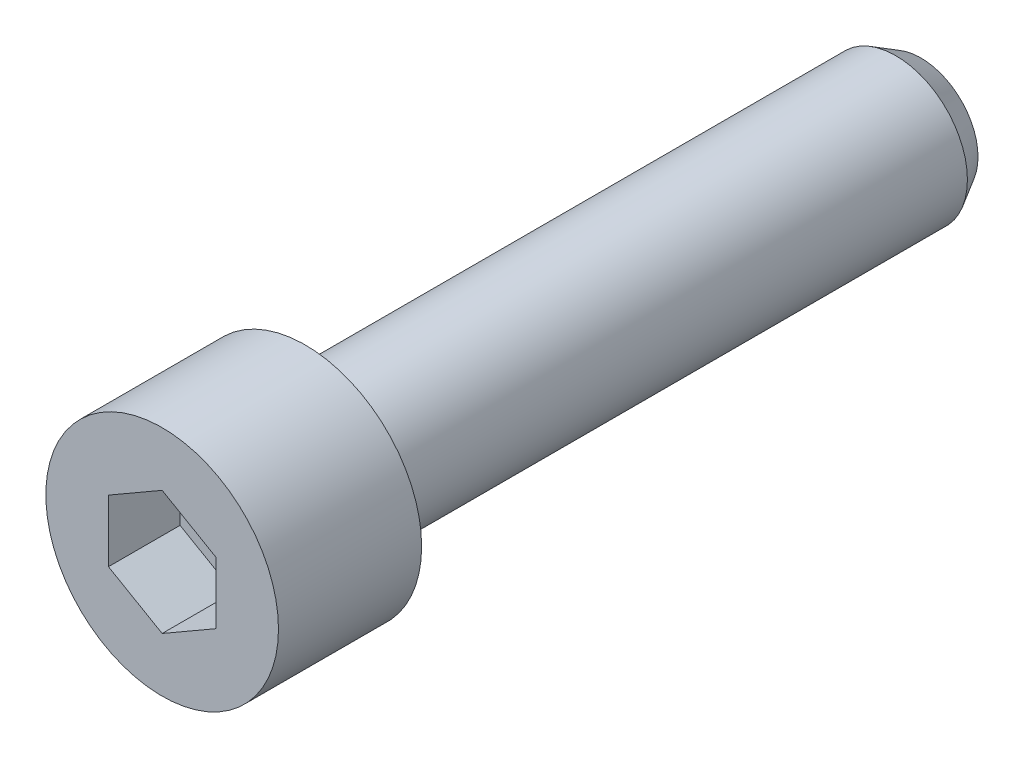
ISO-10303-21;
HEADER;
FILE_DESCRIPTION(('STEP AP214'),'2;1');
FILE_NAME('part.step','',(''),(''),'','','');
FILE_SCHEMA(('AUTOMOTIVE_DESIGN { 1 0 10303 214 1 1 1 1 }'));
ENDSEC;
DATA;
#1=APPLICATION_CONTEXT('core data for automotive mechanical design processes');
#2=APPLICATION_PROTOCOL_DEFINITION('international standard','automotive_design',2000,#1);
#3=PRODUCT_CONTEXT('',#1,'mechanical');
#4=PRODUCT('Part','Part','',(#3));
#5=PRODUCT_RELATED_PRODUCT_CATEGORY('part','',(#4));
#6=PRODUCT_DEFINITION_FORMATION('','',#4);
#7=PRODUCT_DEFINITION_CONTEXT('part definition',#1,'design');
#8=PRODUCT_DEFINITION('design','',#6,#7);
#9=PRODUCT_DEFINITION_SHAPE('','',#8);
#10=(LENGTH_UNIT() NAMED_UNIT(*) SI_UNIT(.MILLI.,.METRE.));
#11=(NAMED_UNIT(*) PLANE_ANGLE_UNIT() SI_UNIT($,.RADIAN.));
#12=(NAMED_UNIT(*) SI_UNIT($,.STERADIAN.) SOLID_ANGLE_UNIT());
#13=UNCERTAINTY_MEASURE_WITH_UNIT(LENGTH_MEASURE(1.E-05),#10,'distance_accuracy_value','');
#14=(GEOMETRIC_REPRESENTATION_CONTEXT(3) GLOBAL_UNCERTAINTY_ASSIGNED_CONTEXT((#13)) GLOBAL_UNIT_ASSIGNED_CONTEXT((#10,
#11,#12)) REPRESENTATION_CONTEXT('',''));
#15=CARTESIAN_POINT('',(0.,0.,0.));
#16=DIRECTION('',(0.,0.,1.));
#17=DIRECTION('',(1.,0.,0.));
#18=AXIS2_PLACEMENT_3D('',#15,#16,#17);
#19=CARTESIAN_POINT('',(0.,0.,1.45));
#20=DIRECTION('',(0.,0.,-1.));
#21=DIRECTION('',(1.,0.,0.));
#22=AXIS2_PLACEMENT_3D('',#19,#20,#21);
#23=SPHERICAL_SURFACE('',#22,2.75);
#24=CARTESIAN_POINT('',(0.,0.,0.601657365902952));
#25=DIRECTION('',(0.,0.,-1.));
#26=DIRECTION('',(1.,0.,0.));
#27=AXIS2_PLACEMENT_3D('',#24,#25,#26);
#28=CIRCLE('',#27,2.61587743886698);
#29=CARTESIAN_POINT('',(2.61587743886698,0.,0.601657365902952));
#30=VERTEX_POINT('',#29);
#31=EDGE_CURVE('E9',#30,#30,#28,.T.);
#32=CARTESIAN_POINT('',(0.,0.,0.));
#33=DIRECTION('',(0.,0.,-1.));
#34=DIRECTION('',(1.,0.,0.));
#35=AXIS2_PLACEMENT_3D('',#32,#33,#34);
#36=CIRCLE('',#35,2.33666428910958);
#37=CARTESIAN_POINT('',(2.33666428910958,0.,0.));
#38=VERTEX_POINT('',#37);
#39=EDGE_CURVE('E17',#38,#38,#36,.F.);
#40=CARTESIAN_POINT('',(2.61587743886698,0.,0.601657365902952));
#41=CARTESIAN_POINT('',(2.61374081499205,0.,0.595069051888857));
#42=CARTESIAN_POINT('',(2.61157930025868,0.,0.588488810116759));
#43=CARTESIAN_POINT('',(2.60720661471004,0.,0.575344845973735));
#44=CARTESIAN_POINT('',(2.60499544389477,0.,0.568781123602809));
#45=CARTESIAN_POINT('',(2.60052357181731,0.,0.55567057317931));
#46=CARTESIAN_POINT('',(2.59826287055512,0.,0.549123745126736));
#47=CARTESIAN_POINT('',(2.59369206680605,0.,0.536047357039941));
#48=CARTESIAN_POINT('',(2.59138196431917,0.,0.529517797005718));
#49=CARTESIAN_POINT('',(2.58671248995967,0.,0.516476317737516));
#50=CARTESIAN_POINT('',(2.58435311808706,0.,0.509964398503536));
#51=CARTESIAN_POINT('',(2.57958523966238,0.,0.496958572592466));
#52=CARTESIAN_POINT('',(2.5771767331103,0.,0.490464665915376));
#53=CARTESIAN_POINT('',(2.57231072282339,0.,0.477495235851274));
#54=CARTESIAN_POINT('',(2.56985321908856,0.,0.471019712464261));
#55=CARTESIAN_POINT('',(2.56488935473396,0.,0.458087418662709));
#56=CARTESIAN_POINT('',(2.56238299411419,0.,0.451630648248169));
#57=CARTESIAN_POINT('',(2.55732155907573,0.,0.438736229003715));
#58=CARTESIAN_POINT('',(2.55476648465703,0.,0.4322985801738));
#59=CARTESIAN_POINT('',(2.54960776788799,0.,0.419442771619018));
#60=CARTESIAN_POINT('',(2.54700412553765,0.,0.413024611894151));
#61=CARTESIAN_POINT('',(2.54174842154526,0.,0.400208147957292));
#62=CARTESIAN_POINT('',(2.53909635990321,0.,0.393809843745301));
#63=CARTESIAN_POINT('',(2.53374396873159,0.,0.381033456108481));
#64=CARTESIAN_POINT('',(2.53104363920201,0.,0.374655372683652));
#65=CARTESIAN_POINT('',(2.52559486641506,0.,0.361919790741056));
#66=CARTESIAN_POINT('',(2.52284642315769,0.,0.355562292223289));
#67=CARTESIAN_POINT('',(2.51730157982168,0.,0.342868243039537));
#68=CARTESIAN_POINT('',(2.51450517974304,0.,0.336531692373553));
#69=CARTESIAN_POINT('',(2.50886458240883,0.,0.323879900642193));
#70=CARTESIAN_POINT('',(2.50602038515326,0.,0.317564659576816));
#71=CARTESIAN_POINT('',(2.50028435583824,0.,0.304955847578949));
#72=CARTESIAN_POINT('',(2.49739252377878,0.,0.298662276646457));
#73=CARTESIAN_POINT('',(2.49156138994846,0.,0.286097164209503));
#74=CARTESIAN_POINT('',(2.4886220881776,0.,0.279825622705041));
#75=CARTESIAN_POINT('',(2.48269618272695,0.,0.267304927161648));
#76=CARTESIAN_POINT('',(2.47970957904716,0.,0.261055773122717));
#77=CARTESIAN_POINT('',(2.47368924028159,0.,0.248580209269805));
#78=CARTESIAN_POINT('',(2.4706555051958,0.,0.242353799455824));
#79=CARTESIAN_POINT('',(2.46454107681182,0.,0.229924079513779));
#80=CARTESIAN_POINT('',(2.46146038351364,0.,0.223720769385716));
#81=CARTESIAN_POINT('',(2.4552522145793,0.,0.211337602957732));
#82=CARTESIAN_POINT('',(2.45212473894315,0.,0.205157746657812));
#83=CARTESIAN_POINT('',(2.44582318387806,0.,0.192821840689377));
#84=CARTESIAN_POINT('',(2.44264910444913,0.,0.186665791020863));
#85=CARTESIAN_POINT('',(2.43625452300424,0.,0.174377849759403));
#86=CARTESIAN_POINT('',(2.43303402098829,0.,0.168245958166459));
#87=CARTESIAN_POINT('',(2.42654677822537,0.,0.156006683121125));
#88=CARTESIAN_POINT('',(2.4232800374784,0.,0.149899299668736));
#89=CARTESIAN_POINT('',(2.41670050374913,0.,0.137709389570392));
#90=CARTESIAN_POINT('',(2.41338771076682,0.,0.131626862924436));
#91=CARTESIAN_POINT('',(2.40671626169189,0.,0.119487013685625));
#92=CARTESIAN_POINT('',(2.40335760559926,0.,0.113429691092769));
#93=CARTESIAN_POINT('',(2.39659462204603,0.,0.101340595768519));
#94=CARTESIAN_POINT('',(2.39319029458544,0.,0.0953088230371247));
#95=CARTESIAN_POINT('',(2.38633616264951,0.,0.08327117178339));
#96=CARTESIAN_POINT('',(2.38288635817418,0.,0.0772652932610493));
#97=CARTESIAN_POINT('',(2.3759414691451,0.,0.0652797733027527));
#98=CARTESIAN_POINT('',(2.37244638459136,0.,0.0593001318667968));
#99=CARTESIAN_POINT('',(2.36541113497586,0.,0.047367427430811));
#100=CARTESIAN_POINT('',(2.3618709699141,0.,0.0414143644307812));
#101=CARTESIAN_POINT('',(2.35474576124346,0.,0.0295351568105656));
#102=CARTESIAN_POINT('',(2.35116071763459,0.,0.0236090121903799));
#103=CARTESIAN_POINT('',(2.34394595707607,0.,0.0117839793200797));
#104=CARTESIAN_POINT('',(2.34031624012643,0.,0.00588509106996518));
#105=CARTESIAN_POINT('',(2.33666428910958,0.,0.));
#106=B_SPLINE_CURVE_WITH_KNOTS('',3,(#40,#41,#42,#43,#44,#45,#46,#47,#48,#49,#50,#51,#52,#53,
#54,#55,#56,#57,#58,#59,#60,#61,#62,#63,#64,#65,#66,#67,#68,#69,#70,#71,#72,#73,#74,#75,#76,#77,
#78,#79,#80,#81,#82,#83,#84,#85,#86,#87,#88,#89,#90,#91,#92,#93,#94,#95,#96,#97,#98,#99,#100,
#101,#102,#103,#104,#105),.UNSPECIFIED.,.F.,.F.,(4,2,2,2,2,2,2,2,2,2,2,2,2,2,2,2,2,2,2,2,2,2,2,
2,2,2,2,2,2,2,2,2,4),(0.,0.0207782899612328,0.0415565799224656,0.0623348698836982,
0.0831131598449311,0.103891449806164,0.124669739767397,0.145448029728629,0.166226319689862,
0.187004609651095,0.207782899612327,0.22856118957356,0.249339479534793,0.270117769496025,
0.290896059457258,0.311674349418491,0.332452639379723,0.353230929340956,0.374009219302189,
0.394787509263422,0.415565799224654,0.436344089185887,0.45712237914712,0.477900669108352,
0.498678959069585,0.519457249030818,0.540235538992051,0.561013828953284,0.581792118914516,
0.602570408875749,0.623348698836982,0.644126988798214,0.664905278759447),.UNSPECIFIED.);
#107=EDGE_CURVE('BSEAM14',#30,#38,#106,.T.);
#108=ORIENTED_EDGE('',*,*,#31,.T.);
#109=ORIENTED_EDGE('',*,*,#39,.T.);
#110=ORIENTED_EDGE('',*,*,#107,.T.);
#111=ORIENTED_EDGE('',*,*,#107,.F.);
#112=EDGE_LOOP('',(#108,#110,#109,#111));
#113=FACE_BOUND('',#112,.T.);
#114=ADVANCED_FACE('F14',(#113),#23,.T.);
#115=CARTESIAN_POINT('',(3.19170962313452,0.,0.601657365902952));
#116=DIRECTION('',(0.,0.,1.));
#117=DIRECTION('',(-1.,0.,0.));
#118=AXIS2_PLACEMENT_3D('',#115,#116,#117);
#119=PLANE('',#118);
#120=ORIENTED_EDGE('',*,*,#31,.F.);
#121=EDGE_LOOP('',(#120));
#122=FACE_BOUND('',#121,.T.);
#123=CARTESIAN_POINT('',(0.,0.,0.601657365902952));
#124=DIRECTION('',(0.,0.,-1.));
#125=DIRECTION('',(1.,0.,0.));
#126=AXIS2_PLACEMENT_3D('',#123,#124,#125);
#127=CIRCLE('',#126,3.19170962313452);
#128=CARTESIAN_POINT('',(3.19170962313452,0.,0.601657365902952));
#129=VERTEX_POINT('',#128);
#130=EDGE_CURVE('E22',#129,#129,#127,.T.);
#131=ORIENTED_EDGE('',*,*,#130,.T.);
#132=EDGE_LOOP('',(#131));
#133=FACE_BOUND('',#132,.T.);
#134=ADVANCED_FACE('F137',(#122,#133),#119,.F.);
#135=CARTESIAN_POINT('',(0.,0.,2.001657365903));
#136=DIRECTION('',(0.,0.,1.));
#137=DIRECTION('',(-1.,0.,0.));
#138=AXIS2_PLACEMENT_3D('',#135,#136,#137);
#139=CONICAL_SURFACE('',#138,4.,0.523598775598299);
#140=ORIENTED_EDGE('',*,*,#130,.F.);
#141=EDGE_LOOP('',(#140));
#142=FACE_BOUND('',#141,.T.);
#143=CARTESIAN_POINT('',(0.,0.,2.001657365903));
#144=DIRECTION('',(0.,0.,-1.));
#145=DIRECTION('',(1.,0.,0.));
#146=AXIS2_PLACEMENT_3D('',#143,#144,#145);
#147=CIRCLE('',#146,4.);
#148=CARTESIAN_POINT('',(4.,0.,2.001657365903));
#149=VERTEX_POINT('',#148);
#150=EDGE_CURVE('E131',#149,#149,#147,.T.);
#151=ORIENTED_EDGE('',*,*,#150,.T.);
#152=EDGE_LOOP('',(#151));
#153=FACE_BOUND('',#152,.T.);
#154=ADVANCED_FACE('F139',(#142,#153),#139,.T.);
#155=CARTESIAN_POINT('',(0.,0.,5.));
#156=DIRECTION('',(0.,0.,-1.));
#157=DIRECTION('',(1.,0.,0.));
#158=AXIS2_PLACEMENT_3D('',#155,#156,#157);
#159=CYLINDRICAL_SURFACE('',#158,4.);
#160=ORIENTED_EDGE('',*,*,#150,.F.);
#161=EDGE_LOOP('',(#160));
#162=FACE_BOUND('',#161,.T.);
#163=CARTESIAN_POINT('',(0.,0.,35.));
#164=DIRECTION('',(0.,0.,-1.));
#165=DIRECTION('',(1.,0.,0.));
#166=AXIS2_PLACEMENT_3D('',#163,#164,#165);
#167=CIRCLE('',#166,4.);
#168=CARTESIAN_POINT('',(4.,0.,35.));
#169=VERTEX_POINT('',#168);
#170=EDGE_CURVE('E128',#169,#169,#167,.T.);
#171=ORIENTED_EDGE('',*,*,#170,.T.);
#172=EDGE_LOOP('',(#171));
#173=FACE_BOUND('',#172,.T.);
#174=ADVANCED_FACE('F142',(#162,#173),#159,.T.);
#175=CARTESIAN_POINT('',(4.,0.,35.));
#176=DIRECTION('',(0.,0.,-1.));
#177=DIRECTION('',(1.,0.,0.));
#178=AXIS2_PLACEMENT_3D('',#175,#176,#177);
#179=PLANE('',#178);
#180=CARTESIAN_POINT('',(0.,0.,35.));
#181=DIRECTION('',(0.,0.,-1.));
#182=DIRECTION('',(1.,0.,0.));
#183=AXIS2_PLACEMENT_3D('',#180,#181,#182);
#184=CIRCLE('',#183,6.5);
#185=CARTESIAN_POINT('',(6.5,0.,35.));
#186=VERTEX_POINT('',#185);
#187=EDGE_CURVE('E125',#186,#186,#184,.T.);
#188=ORIENTED_EDGE('',*,*,#187,.T.);
#189=EDGE_LOOP('',(#188));
#190=FACE_BOUND('',#189,.T.);
#191=ORIENTED_EDGE('',*,*,#170,.F.);
#192=EDGE_LOOP('',(#191));
#193=FACE_BOUND('',#192,.T.);
#194=ADVANCED_FACE('F148',(#190,#193),#179,.T.);
#195=CARTESIAN_POINT('',(0.,0.,5.));
#196=DIRECTION('',(0.,0.,-1.));
#197=DIRECTION('',(1.,0.,0.));
#198=AXIS2_PLACEMENT_3D('',#195,#196,#197);
#199=CYLINDRICAL_SURFACE('',#198,6.5);
#200=CARTESIAN_POINT('',(0.,0.,43.));
#201=DIRECTION('',(0.,0.,-1.));
#202=DIRECTION('',(1.,0.,0.));
#203=AXIS2_PLACEMENT_3D('',#200,#201,#202);
#204=CIRCLE('',#203,6.5);
#205=CARTESIAN_POINT('',(6.5,0.,43.));
#206=VERTEX_POINT('',#205);
#207=EDGE_CURVE('E122',#206,#206,#204,.T.);
#208=ORIENTED_EDGE('',*,*,#207,.T.);
#209=EDGE_LOOP('',(#208));
#210=FACE_BOUND('',#209,.T.);
#211=ORIENTED_EDGE('',*,*,#187,.F.);
#212=EDGE_LOOP('',(#211));
#213=FACE_BOUND('',#212,.T.);
#214=ADVANCED_FACE('F153',(#210,#213),#199,.T.);
#215=CARTESIAN_POINT('',(6.5,0.,43.));
#216=DIRECTION('',(0.,0.,1.));
#217=DIRECTION('',(-1.,0.,0.));
#218=AXIS2_PLACEMENT_3D('',#215,#216,#217);
#219=PLANE('',#218);
#220=DIRECTION('',(-0.86602540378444,0.5,0.));
#221=VECTOR('',#220,1.);
#222=CARTESIAN_POINT('',(3.,1.73205080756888,43.));
#223=LINE('',#222,#221);
#224=CARTESIAN_POINT('',(3.,1.73205080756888,43.));
#225=VERTEX_POINT('',#224);
#226=CARTESIAN_POINT('',(0.,3.46410161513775,43.));
#227=VERTEX_POINT('',#226);
#228=EDGE_CURVE('E29',#225,#227,#223,.T.);
#229=ORIENTED_EDGE('',*,*,#228,.F.);
#230=DIRECTION('',(0.,1.,0.));
#231=VECTOR('',#230,1.);
#232=CARTESIAN_POINT('',(3.,-1.73205080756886,43.));
#233=LINE('',#232,#231);
#234=CARTESIAN_POINT('',(3.,-1.73205080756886,43.));
#235=VERTEX_POINT('',#234);
#236=EDGE_CURVE('E98',#235,#225,#233,.T.);
#237=ORIENTED_EDGE('',*,*,#236,.F.);
#238=DIRECTION('',(-0.866025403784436,-0.5,0.));
#239=VECTOR('',#238,1.);
#240=CARTESIAN_POINT('',(3.,-1.73205080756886,43.));
#241=LINE('',#240,#239);
#242=CARTESIAN_POINT('',(0.,-3.46410161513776,43.));
#243=VERTEX_POINT('',#242);
#244=EDGE_CURVE('E93',#235,#243,#241,.T.);
#245=ORIENTED_EDGE('',*,*,#244,.T.);
#246=DIRECTION('',(0.866025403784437,-0.5,0.));
#247=VECTOR('',#246,1.);
#248=CARTESIAN_POINT('',(-3.,-1.73205080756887,43.));
#249=LINE('',#248,#247);
#250=CARTESIAN_POINT('',(-3.,-1.73205080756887,43.));
#251=VERTEX_POINT('',#250);
#252=EDGE_CURVE('E91',#251,#243,#249,.T.);
#253=ORIENTED_EDGE('',*,*,#252,.F.);
#254=DIRECTION('',(0.,1.,0.));
#255=VECTOR('',#254,1.);
#256=CARTESIAN_POINT('',(-3.,-1.73205080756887,43.));
#257=LINE('',#256,#255);
#258=CARTESIAN_POINT('',(-3.,1.73205080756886,43.));
#259=VERTEX_POINT('',#258);
#260=EDGE_CURVE('E72',#251,#259,#257,.T.);
#261=ORIENTED_EDGE('',*,*,#260,.T.);
#262=DIRECTION('',(0.866025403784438,0.5,0.));
#263=VECTOR('',#262,1.);
#264=CARTESIAN_POINT('',(-3.,1.73205080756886,43.));
#265=LINE('',#264,#263);
#266=EDGE_CURVE('E83',#259,#227,#265,.T.);
#267=ORIENTED_EDGE('',*,*,#266,.T.);
#268=EDGE_LOOP('',(#229,#237,#245,#253,#261,#267));
#269=FACE_BOUND('',#268,.T.);
#270=ORIENTED_EDGE('',*,*,#207,.F.);
#271=EDGE_LOOP('',(#270));
#272=FACE_BOUND('',#271,.T.);
#273=ADVANCED_FACE('F87',(#269,#272),#219,.T.);
#274=CARTESIAN_POINT('',(3.,1.73205080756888,39.));
#275=DIRECTION('',(0.5,0.86602540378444,0.));
#276=DIRECTION('',(0.86602540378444,-0.5,0.));
#277=AXIS2_PLACEMENT_3D('',#274,#275,#276);
#278=PLANE('',#277);
#279=DIRECTION('',(0.,0.,1.));
#280=VECTOR('',#279,1.);
#281=CARTESIAN_POINT('',(3.,1.73205080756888,39.));
#282=LINE('',#281,#280);
#283=CARTESIAN_POINT('',(3.,1.73205080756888,39.));
#284=VERTEX_POINT('',#283);
#285=EDGE_CURVE('E36',#284,#225,#282,.T.);
#286=ORIENTED_EDGE('',*,*,#285,.T.);
#287=ORIENTED_EDGE('',*,*,#228,.T.);
#288=DIRECTION('',(0.,0.,1.));
#289=VECTOR('',#288,1.);
#290=CARTESIAN_POINT('',(0.,3.46410161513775,39.));
#291=LINE('',#290,#289);
#292=CARTESIAN_POINT('',(0.,3.46410161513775,39.));
#293=VERTEX_POINT('',#292);
#294=EDGE_CURVE('E80',#293,#227,#291,.T.);
#295=ORIENTED_EDGE('',*,*,#294,.F.);
#296=DIRECTION('',(-0.86602540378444,0.5,0.));
#297=VECTOR('',#296,1.);
#298=CARTESIAN_POINT('',(3.,1.73205080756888,39.));
#299=LINE('',#298,#297);
#300=EDGE_CURVE('E100',#284,#293,#299,.T.);
#301=ORIENTED_EDGE('',*,*,#300,.F.);
#302=EDGE_LOOP('',(#286,#287,#295,#301));
#303=FACE_BOUND('',#302,.T.);
#304=ADVANCED_FACE('F190',(#303),#278,.F.);
#305=CARTESIAN_POINT('',(3.,-1.73205080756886,39.));
#306=DIRECTION('',(1.,0.,0.));
#307=DIRECTION('',(0.,-1.,0.));
#308=AXIS2_PLACEMENT_3D('',#305,#306,#307);
#309=PLANE('',#308);
#310=DIRECTION('',(0.,0.,1.));
#311=VECTOR('',#310,1.);
#312=CARTESIAN_POINT('',(3.,-1.73205080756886,39.));
#313=LINE('',#312,#311);
#314=CARTESIAN_POINT('',(3.,-1.73205080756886,39.));
#315=VERTEX_POINT('',#314);
#316=EDGE_CURVE('E119',#315,#235,#313,.T.);
#317=ORIENTED_EDGE('',*,*,#316,.T.);
#318=ORIENTED_EDGE('',*,*,#236,.T.);
#319=ORIENTED_EDGE('',*,*,#285,.F.);
#320=DIRECTION('',(0.,1.,0.));
#321=VECTOR('',#320,1.);
#322=CARTESIAN_POINT('',(3.,-1.73205080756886,39.));
#323=LINE('',#322,#321);
#324=EDGE_CURVE('E112',#315,#284,#323,.T.);
#325=ORIENTED_EDGE('',*,*,#324,.F.);
#326=EDGE_LOOP('',(#317,#318,#319,#325));
#327=FACE_BOUND('',#326,.T.);
#328=ADVANCED_FACE('F198',(#327),#309,.F.);
#329=CARTESIAN_POINT('',(3.,-1.73205080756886,39.));
#330=DIRECTION('',(-0.5,0.866025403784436,0.));
#331=DIRECTION('',(0.866025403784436,0.5,0.));
#332=AXIS2_PLACEMENT_3D('',#329,#330,#331);
#333=PLANE('',#332);
#334=DIRECTION('',(0.,0.,1.));
#335=VECTOR('',#334,1.);
#336=CARTESIAN_POINT('',(0.,-3.46410161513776,39.));
#337=LINE('',#336,#335);
#338=CARTESIAN_POINT('',(0.,-3.46410161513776,39.));
#339=VERTEX_POINT('',#338);
#340=EDGE_CURVE('E117',#339,#243,#337,.T.);
#341=ORIENTED_EDGE('',*,*,#340,.T.);
#342=ORIENTED_EDGE('',*,*,#244,.F.);
#343=ORIENTED_EDGE('',*,*,#316,.F.);
#344=DIRECTION('',(-0.866025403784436,-0.5,0.));
#345=VECTOR('',#344,1.);
#346=CARTESIAN_POINT('',(3.,-1.73205080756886,39.));
#347=LINE('',#346,#345);
#348=EDGE_CURVE('E109',#315,#339,#347,.T.);
#349=ORIENTED_EDGE('',*,*,#348,.T.);
#350=EDGE_LOOP('',(#341,#342,#343,#349));
#351=FACE_BOUND('',#350,.T.);
#352=ADVANCED_FACE('F194',(#351),#333,.T.);
#353=CARTESIAN_POINT('',(-3.,-1.73205080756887,39.));
#354=DIRECTION('',(-0.5,-0.866025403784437,0.));
#355=DIRECTION('',(-0.866025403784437,0.5,0.));
#356=AXIS2_PLACEMENT_3D('',#353,#354,#355);
#357=PLANE('',#356);
#358=DIRECTION('',(0.,0.,1.));
#359=VECTOR('',#358,1.);
#360=CARTESIAN_POINT('',(-3.,-1.73205080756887,39.));
#361=LINE('',#360,#359);
#362=CARTESIAN_POINT('',(-3.,-1.73205080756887,39.));
#363=VERTEX_POINT('',#362);
#364=EDGE_CURVE('E79',#363,#251,#361,.T.);
#365=ORIENTED_EDGE('',*,*,#364,.T.);
#366=ORIENTED_EDGE('',*,*,#252,.T.);
#367=ORIENTED_EDGE('',*,*,#340,.F.);
#368=DIRECTION('',(0.866025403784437,-0.5,0.));
#369=VECTOR('',#368,1.);
#370=CARTESIAN_POINT('',(-3.,-1.73205080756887,39.));
#371=LINE('',#370,#369);
#372=EDGE_CURVE('E106',#363,#339,#371,.T.);
#373=ORIENTED_EDGE('',*,*,#372,.F.);
#374=EDGE_LOOP('',(#365,#366,#367,#373));
#375=FACE_BOUND('',#374,.T.);
#376=ADVANCED_FACE('F187',(#375),#357,.F.);
#377=CARTESIAN_POINT('',(-3.,-1.73205080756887,39.));
#378=DIRECTION('',(1.,0.,0.));
#379=DIRECTION('',(0.,-1.,0.));
#380=AXIS2_PLACEMENT_3D('',#377,#378,#379);
#381=PLANE('',#380);
#382=DIRECTION('',(0.,0.,1.));
#383=VECTOR('',#382,1.);
#384=CARTESIAN_POINT('',(-3.,1.73205080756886,39.));
#385=LINE('',#384,#383);
#386=CARTESIAN_POINT('',(-3.,1.73205080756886,39.));
#387=VERTEX_POINT('',#386);
#388=EDGE_CURVE('E68',#387,#259,#385,.T.);
#389=ORIENTED_EDGE('',*,*,#388,.T.);
#390=ORIENTED_EDGE('',*,*,#260,.F.);
#391=ORIENTED_EDGE('',*,*,#364,.F.);
#392=DIRECTION('',(0.,1.,0.));
#393=VECTOR('',#392,1.);
#394=CARTESIAN_POINT('',(-3.,-1.73205080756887,39.));
#395=LINE('',#394,#393);
#396=EDGE_CURVE('E75',#363,#387,#395,.T.);
#397=ORIENTED_EDGE('',*,*,#396,.T.);
#398=EDGE_LOOP('',(#389,#390,#391,#397));
#399=FACE_BOUND('',#398,.T.);
#400=ADVANCED_FACE('F70',(#399),#381,.T.);
#401=CARTESIAN_POINT('',(-3.,1.73205080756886,39.));
#402=DIRECTION('',(0.5,-0.866025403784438,0.));
#403=DIRECTION('',(-0.866025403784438,-0.5,0.));
#404=AXIS2_PLACEMENT_3D('',#401,#402,#403);
#405=PLANE('',#404);
#406=DIRECTION('',(0.866025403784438,0.5,0.));
#407=VECTOR('',#406,1.);
#408=CARTESIAN_POINT('',(-3.,1.73205080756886,39.));
#409=LINE('',#408,#407);
#410=EDGE_CURVE('E103',#387,#293,#409,.T.);
#411=ORIENTED_EDGE('',*,*,#410,.T.);
#412=ORIENTED_EDGE('',*,*,#294,.T.);
#413=ORIENTED_EDGE('',*,*,#266,.F.);
#414=ORIENTED_EDGE('',*,*,#388,.F.);
#415=EDGE_LOOP('',(#411,#412,#413,#414));
#416=FACE_BOUND('',#415,.T.);
#417=ADVANCED_FACE('F84',(#416),#405,.T.);
#418=CARTESIAN_POINT('',(6.,0.,39.));
#419=DIRECTION('',(0.,0.,1.));
#420=DIRECTION('',(-1.,0.,0.));
#421=AXIS2_PLACEMENT_3D('',#418,#419,#420);
#422=PLANE('',#421);
#423=ORIENTED_EDGE('',*,*,#300,.T.);
#424=ORIENTED_EDGE('',*,*,#410,.F.);
#425=ORIENTED_EDGE('',*,*,#396,.F.);
#426=ORIENTED_EDGE('',*,*,#372,.T.);
#427=ORIENTED_EDGE('',*,*,#348,.F.);
#428=ORIENTED_EDGE('',*,*,#324,.T.);
#429=EDGE_LOOP('',(#423,#424,#425,#426,#427,#428));
#430=FACE_BOUND('',#429,.T.);
#431=ADVANCED_FACE('F175',(#430),#422,.T.);
#432=CARTESIAN_POINT('',(0.,0.,0.));
#433=DIRECTION('',(0.,0.,-1.));
#434=DIRECTION('',(1.,0.,0.));
#435=AXIS2_PLACEMENT_3D('',#432,#433,#434);
#436=PLANE('',#435);
#437=ORIENTED_EDGE('',*,*,#39,.F.);
#438=EDGE_LOOP('',(#437));
#439=FACE_BOUND('',#438,.T.);
#440=ADVANCED_FACE('F173',(#439),#436,.T.);
#441=CLOSED_SHELL('',(#114,#134,#154,#174,#194,#214,#273,#304,#328,#352,#376,#400,#417,#431,#440));
#442=MANIFOLD_SOLID_BREP('B1',#441);
#443=ADVANCED_BREP_SHAPE_REPRESENTATION('',(#18,#442),#14);
#444=SHAPE_DEFINITION_REPRESENTATION(#9,#443);
ENDSEC;
END-ISO-10303-21;
